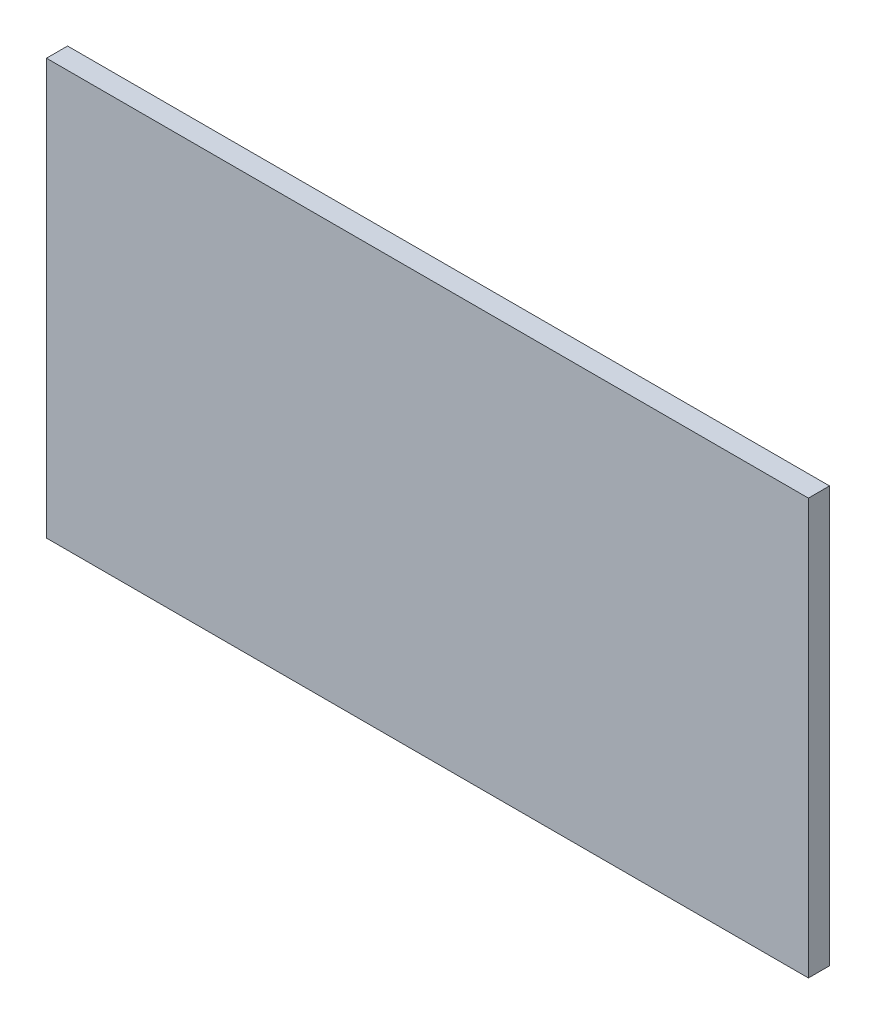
ISO-10303-21;
HEADER;
FILE_DESCRIPTION(('STEP AP214'),'2;1');
FILE_NAME('part.step','',(''),(''),'','','');
FILE_SCHEMA(('AUTOMOTIVE_DESIGN { 1 0 10303 214 1 1 1 1 }'));
ENDSEC;
DATA;
#1=APPLICATION_CONTEXT('core data for automotive mechanical design processes');
#2=APPLICATION_PROTOCOL_DEFINITION('international standard','automotive_design',2000,#1);
#3=PRODUCT_CONTEXT('',#1,'mechanical');
#4=PRODUCT('Part','Part','',(#3));
#5=PRODUCT_RELATED_PRODUCT_CATEGORY('part','',(#4));
#6=PRODUCT_DEFINITION_FORMATION('','',#4);
#7=PRODUCT_DEFINITION_CONTEXT('part definition',#1,'design');
#8=PRODUCT_DEFINITION('design','',#6,#7);
#9=PRODUCT_DEFINITION_SHAPE('','',#8);
#10=(LENGTH_UNIT() NAMED_UNIT(*) SI_UNIT(.MILLI.,.METRE.));
#11=(NAMED_UNIT(*) PLANE_ANGLE_UNIT() SI_UNIT($,.RADIAN.));
#12=(NAMED_UNIT(*) SI_UNIT($,.STERADIAN.) SOLID_ANGLE_UNIT());
#13=UNCERTAINTY_MEASURE_WITH_UNIT(LENGTH_MEASURE(1.E-05),#10,'distance_accuracy_value','');
#14=(GEOMETRIC_REPRESENTATION_CONTEXT(3) GLOBAL_UNCERTAINTY_ASSIGNED_CONTEXT((#13)) GLOBAL_UNIT_ASSIGNED_CONTEXT((#10,
#11,#12)) REPRESENTATION_CONTEXT('',''));
#15=CARTESIAN_POINT('',(0.,0.,0.));
#16=DIRECTION('',(0.,0.,1.));
#17=DIRECTION('',(1.,0.,0.));
#18=AXIS2_PLACEMENT_3D('',#15,#16,#17);
#19=CARTESIAN_POINT('',(9.15,10.45,-0.03048));
#20=DIRECTION('',(0.,-1.,0.));
#21=DIRECTION('',(0.,0.,-1.));
#22=AXIS2_PLACEMENT_3D('',#19,#20,#21);
#23=PLANE('',#22);
#24=DIRECTION('',(1.,0.,0.));
#25=VECTOR('',#24,1.);
#26=CARTESIAN_POINT('',(9.7,10.45,0.));
#27=LINE('',#26,#25);
#28=CARTESIAN_POINT('',(9.15,10.45,0.));
#29=VERTEX_POINT('',#28);
#30=CARTESIAN_POINT('',(10.25,10.45,0.));
#31=VERTEX_POINT('',#30);
#32=EDGE_CURVE('E73',#29,#31,#27,.T.);
#33=ORIENTED_EDGE('',*,*,#32,.T.);
#34=DIRECTION('',(0.,0.,-1.));
#35=VECTOR('',#34,1.);
#36=CARTESIAN_POINT('',(10.25,10.45,-0.01524));
#37=LINE('',#36,#35);
#38=CARTESIAN_POINT('',(10.25,10.45,-0.03048));
#39=VERTEX_POINT('',#38);
#40=EDGE_CURVE('E97',#31,#39,#37,.T.);
#41=ORIENTED_EDGE('',*,*,#40,.T.);
#42=DIRECTION('',(1.,0.,0.));
#43=VECTOR('',#42,1.);
#44=CARTESIAN_POINT('',(9.15,10.45,-0.03048));
#45=LINE('',#44,#43);
#46=CARTESIAN_POINT('',(9.15,10.45,-0.03048));
#47=VERTEX_POINT('',#46);
#48=EDGE_CURVE('E75',#47,#39,#45,.T.);
#49=ORIENTED_EDGE('',*,*,#48,.F.);
#50=DIRECTION('',(0.,0.,-1.));
#51=VECTOR('',#50,1.);
#52=CARTESIAN_POINT('',(9.15,10.45,-0.01524));
#53=LINE('',#52,#51);
#54=EDGE_CURVE('E11',#29,#47,#53,.T.);
#55=ORIENTED_EDGE('',*,*,#54,.F.);
#56=EDGE_LOOP('',(#33,#41,#49,#55));
#57=FACE_BOUND('',#56,.T.);
#58=ADVANCED_FACE('F17',(#57),#23,.F.);
#59=CARTESIAN_POINT('',(9.15,9.85,-0.03048));
#60=DIRECTION('',(1.,0.,0.));
#61=DIRECTION('',(0.,1.,0.));
#62=AXIS2_PLACEMENT_3D('',#59,#60,#61);
#63=PLANE('',#62);
#64=DIRECTION('',(0.,1.,0.));
#65=VECTOR('',#64,1.);
#66=CARTESIAN_POINT('',(9.15,10.15,0.));
#67=LINE('',#66,#65);
#68=CARTESIAN_POINT('',(9.15,9.85,0.));
#69=VERTEX_POINT('',#68);
#70=EDGE_CURVE('E79',#69,#29,#67,.T.);
#71=ORIENTED_EDGE('',*,*,#70,.T.);
#72=ORIENTED_EDGE('',*,*,#54,.T.);
#73=DIRECTION('',(0.,1.,0.));
#74=VECTOR('',#73,1.);
#75=CARTESIAN_POINT('',(9.15,9.85,-0.03048));
#76=LINE('',#75,#74);
#77=CARTESIAN_POINT('',(9.15,9.85,-0.03048));
#78=VERTEX_POINT('',#77);
#79=EDGE_CURVE('E96',#78,#47,#76,.T.);
#80=ORIENTED_EDGE('',*,*,#79,.F.);
#81=DIRECTION('',(0.,0.,-1.));
#82=VECTOR('',#81,1.);
#83=CARTESIAN_POINT('',(9.15,9.85,-0.01524));
#84=LINE('',#83,#82);
#85=EDGE_CURVE('E25',#69,#78,#84,.T.);
#86=ORIENTED_EDGE('',*,*,#85,.F.);
#87=EDGE_LOOP('',(#71,#72,#80,#86));
#88=FACE_BOUND('',#87,.T.);
#89=ADVANCED_FACE('F80',(#88),#63,.F.);
#90=CARTESIAN_POINT('',(10.25,9.85,-0.03048));
#91=DIRECTION('',(0.,1.,0.));
#92=DIRECTION('',(1.,0.,0.));
#93=AXIS2_PLACEMENT_3D('',#90,#91,#92);
#94=PLANE('',#93);
#95=DIRECTION('',(-1.,0.,0.));
#96=VECTOR('',#95,1.);
#97=CARTESIAN_POINT('',(9.7,9.85,0.));
#98=LINE('',#97,#96);
#99=CARTESIAN_POINT('',(10.25,9.85,0.));
#100=VERTEX_POINT('',#99);
#101=EDGE_CURVE('E84',#100,#69,#98,.T.);
#102=ORIENTED_EDGE('',*,*,#101,.T.);
#103=ORIENTED_EDGE('',*,*,#85,.T.);
#104=DIRECTION('',(-1.,0.,0.));
#105=VECTOR('',#104,1.);
#106=CARTESIAN_POINT('',(10.25,9.85,-0.03048));
#107=LINE('',#106,#105);
#108=CARTESIAN_POINT('',(10.25,9.85,-0.03048));
#109=VERTEX_POINT('',#108);
#110=EDGE_CURVE('E101',#109,#78,#107,.T.);
#111=ORIENTED_EDGE('',*,*,#110,.F.);
#112=DIRECTION('',(0.,0.,-1.));
#113=VECTOR('',#112,1.);
#114=CARTESIAN_POINT('',(10.25,9.85,-0.01524));
#115=LINE('',#114,#113);
#116=EDGE_CURVE('E46',#100,#109,#115,.T.);
#117=ORIENTED_EDGE('',*,*,#116,.F.);
#118=EDGE_LOOP('',(#102,#103,#111,#117));
#119=FACE_BOUND('',#118,.T.);
#120=ADVANCED_FACE('F119',(#119),#94,.F.);
#121=CARTESIAN_POINT('',(10.25,10.45,-0.03048));
#122=DIRECTION('',(-1.,0.,0.));
#123=DIRECTION('',(0.,0.,1.));
#124=AXIS2_PLACEMENT_3D('',#121,#122,#123);
#125=PLANE('',#124);
#126=DIRECTION('',(0.,-1.,0.));
#127=VECTOR('',#126,1.);
#128=CARTESIAN_POINT('',(10.25,10.15,0.));
#129=LINE('',#128,#127);
#130=EDGE_CURVE('E88',#31,#100,#129,.T.);
#131=ORIENTED_EDGE('',*,*,#130,.T.);
#132=ORIENTED_EDGE('',*,*,#116,.T.);
#133=DIRECTION('',(0.,-1.,0.));
#134=VECTOR('',#133,1.);
#135=CARTESIAN_POINT('',(10.25,10.45,-0.03048));
#136=LINE('',#135,#134);
#137=EDGE_CURVE('E105',#39,#109,#136,.T.);
#138=ORIENTED_EDGE('',*,*,#137,.F.);
#139=ORIENTED_EDGE('',*,*,#40,.F.);
#140=EDGE_LOOP('',(#131,#132,#138,#139));
#141=FACE_BOUND('',#140,.T.);
#142=ADVANCED_FACE('F120',(#141),#125,.F.);
#143=CARTESIAN_POINT('',(9.7,10.15,-0.03048));
#144=DIRECTION('',(0.,0.,1.));
#145=DIRECTION('',(1.,0.,0.));
#146=AXIS2_PLACEMENT_3D('',#143,#144,#145);
#147=PLANE('',#146);
#148=ORIENTED_EDGE('',*,*,#48,.T.);
#149=ORIENTED_EDGE('',*,*,#137,.T.);
#150=ORIENTED_EDGE('',*,*,#110,.T.);
#151=ORIENTED_EDGE('',*,*,#79,.T.);
#152=EDGE_LOOP('',(#148,#149,#150,#151));
#153=FACE_BOUND('',#152,.T.);
#154=ADVANCED_FACE('F118',(#153),#147,.F.);
#155=CARTESIAN_POINT('',(9.7,10.15,0.));
#156=DIRECTION('',(0.,0.,1.));
#157=DIRECTION('',(1.,0.,0.));
#158=AXIS2_PLACEMENT_3D('',#155,#156,#157);
#159=PLANE('',#158);
#160=ORIENTED_EDGE('',*,*,#32,.F.);
#161=ORIENTED_EDGE('',*,*,#70,.F.);
#162=ORIENTED_EDGE('',*,*,#101,.F.);
#163=ORIENTED_EDGE('',*,*,#130,.F.);
#164=EDGE_LOOP('',(#160,#161,#162,#163));
#165=FACE_BOUND('',#164,.T.);
#166=ADVANCED_FACE('F87',(#165),#159,.T.);
#167=CLOSED_SHELL('',(#58,#89,#120,#142,#154,#166));
#168=MANIFOLD_SOLID_BREP('B1',#167);
#169=ADVANCED_BREP_SHAPE_REPRESENTATION('',(#18,#168),#14);
#170=SHAPE_DEFINITION_REPRESENTATION(#9,#169);
ENDSEC;
END-ISO-10303-21;
